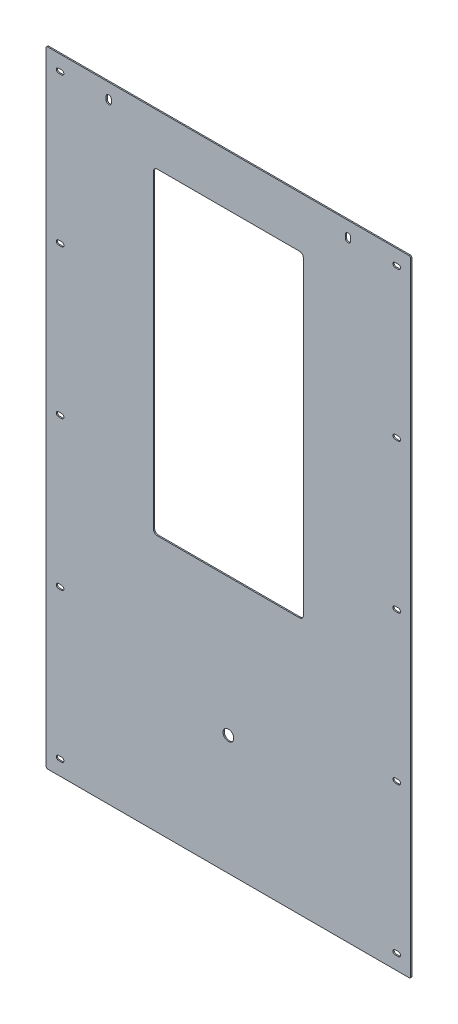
from build123d import *

# Parameters (mm, degrees)
SKIZZE1_W                       = 457
SKIZZE1_H                       = 784
AUFSATZ_LINEAR_AUSTRAGEN1_DEPTH = 1.5
SCHNITT_LINEAR_AUSTRAGEN1_DEPTH = 454.738360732
DURCHGANGSLOCH_F_R_M51_D        = 5.5
SCHNITT_LINEAR_AUSTRAGEN3_DEPTH = 454.738360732
VERRUNDUNG2_R                   = 2
DURCHGANGSLOCH_F_R_M61_D        = 6.6
SCHNITT_LINEAR_AUSTRAGEN5_DEPTH = 454.738360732
SKIZZE13_R                      = 6.7
SCHNITT_LINEAR_AUSTRAGEN6_DEPTH = 10
DURCHGANGSLOCH_F_R_M52_D        = 5.5


with BuildPart() as part:
    # Skizze1 → Aufsatz-Linear austragen1 (new body)
    with BuildSketch(Plane.XY):
        Rectangle(SKIZZE1_W, SKIZZE1_H)
    extrude(amount=AUFSATZ_LINEAR_AUSTRAGEN1_DEPTH)

    # Skizze2 → Schnitt-Linear austragen1 (cut, through all)
    with BuildSketch(Plane.XY.offset(1.5)):
        with BuildLine():
            Line((-89, -70), (89, -70))
            ThreePointArc((89, -70), (92.535533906, -68.535533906), (94, -65))
            Line((94, -65), (94, 323))
            ThreePointArc((94, 323), (92.535533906, 326.535533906), (89, 328))
            Line((89, 328), (-89, 328))
            ThreePointArc((-89, 328), (-92.535533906, 326.535533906), (-94, 323))
            Line((-94, 323), (-94, -65))
            ThreePointArc((-94, -65), (-92.535533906, -68.535533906), (-89, -70))
        make_face()
    extrude(amount=-SCHNITT_LINEAR_AUSTRAGEN1_DEPTH, mode=Mode.SUBTRACT)

    # Durchgangsloch f_r M51 (through all)
    with Locations(Plane.XY.offset(1.5)):
        with Locations((-211, 373), (-211, 0), (-211, -373), (211, -373), (211, 0), (211, 373), (211, 186.5), (211, -186.5), (-211, -186.5), (-211, 186.5)):
            Hole(DURCHGANGSLOCH_F_R_M51_D / 2)

    # Skizze6 → Schnitt-Linear austragen3 (cut, through all)
    with BuildSketch(Plane.XY.offset(1.5)):
        with BuildLine():
            Line((213, 370.25), (209, 370.25))
            ThreePointArc((209, 370.25), (206.25, 373), (209, 375.75))
            Line((209, 375.75), (213, 375.75))
            ThreePointArc((213, 375.75), (215.75, 373), (213, 370.25))
        make_face()
        with BuildLine():
            Line((213, 183.75), (209, 183.75))
            ThreePointArc((209, 183.75), (206.25, 186.5), (209, 189.25))
            Line((209, 189.25), (213, 189.25))
            ThreePointArc((213, 189.25), (215.75, 186.5), (213, 183.75))
        make_face()
        with BuildLine():
            Line((213, -2.75), (209, -2.75))
            ThreePointArc((209, -2.75), (206.25, 0), (209, 2.75))
            Line((209, 2.75), (213, 2.75))
            ThreePointArc((213, 2.75), (215.75, 0), (213, -2.75))
        make_face()
        with BuildLine():
            Line((213, -189.25), (209, -189.25))
            ThreePointArc((209, -189.25), (206.25, -186.5), (209, -183.75))
            Line((209, -183.75), (213, -183.75))
            ThreePointArc((213, -183.75), (215.75, -186.5), (213, -189.25))
        make_face()
        with BuildLine():
            Line((213, -375.75), (209, -375.75))
            ThreePointArc((209, -375.75), (206.25, -373), (209, -370.25))
            Line((209, -370.25), (213, -370.25))
            ThreePointArc((213, -370.25), (215.75, -373), (213, -375.75))
        make_face()
        with BuildLine():
            Line((-213, 370.25), (-209, 370.25))
            ThreePointArc((-209, 370.25), (-206.25, 373), (-209, 375.75))
            Line((-209, 375.75), (-213, 375.75))
            ThreePointArc((-213, 375.75), (-215.75, 373), (-213, 370.25))
        make_face()
        with BuildLine():
            Line((-213, 183.75), (-209, 183.75))
            ThreePointArc((-209, 183.75), (-206.25, 186.5), (-209, 189.25))
            Line((-209, 189.25), (-213, 189.25))
            ThreePointArc((-213, 189.25), (-215.75, 186.5), (-213, 183.75))
        make_face()
        with BuildLine():
            Line((-213, -2.75), (-209, -2.75))
            ThreePointArc((-209, -2.75), (-206.25, 0), (-209, 2.75))
            Line((-209, 2.75), (-213, 2.75))
            ThreePointArc((-213, 2.75), (-215.75, 0), (-213, -2.75))
        make_face()
        with BuildLine():
            Line((-213, -189.25), (-209, -189.25))
            ThreePointArc((-209, -189.25), (-206.25, -186.5), (-209, -183.75))
            Line((-209, -183.75), (-213, -183.75))
            ThreePointArc((-213, -183.75), (-215.75, -186.5), (-213, -189.25))
        make_face()
        with BuildLine():
            Line((-213, -375.75), (-209, -375.75))
            ThreePointArc((-209, -375.75), (-206.25, -373), (-209, -370.25))
            Line((-209, -370.25), (-213, -370.25))
            ThreePointArc((-213, -370.25), (-215.75, -373), (-213, -375.75))
        make_face()
    extrude(amount=-SCHNITT_LINEAR_AUSTRAGEN3_DEPTH, mode=Mode.SUBTRACT)

    # Verrundung2
    verrundung2_edges = [part.edges().sort_by_distance(p)[0] for p in [
        (-228.5, -392, 0.75),
        (228.5, -392, 0.75),
        (228.5, 392, 0.75),
        (-228.5, 392, 0.75),
    ]]
    fillet(verrundung2_edges, radius=VERRUNDUNG2_R)

    # Durchgangsloch f_r M61 (through all)
    with Locations(Plane.XY.offset(1.5)):
        with Locations((-150, 373), (150, 373)):
            Hole(DURCHGANGSLOCH_F_R_M61_D / 2)

    # Skizze12 → Schnitt-Linear austragen5 (cut, through all)
    with BuildSketch(Plane.XY.offset(1.5)):
        with BuildLine():
            Line((-153.3, 371), (-153.3, 375))
            ThreePointArc((-153.3, 375), (-150, 378.3), (-146.7, 375))
            Line((-146.7, 375), (-146.7, 371))
            ThreePointArc((-146.7, 371), (-150, 367.7), (-153.3, 371))
        make_face()
        with BuildLine():
            Line((146.7, 371), (146.7, 375))
            ThreePointArc((146.7, 375), (150, 378.3), (153.3, 375))
            Line((153.3, 375), (153.3, 371))
            ThreePointArc((153.3, 371), (150, 367.7), (146.7, 371))
        make_face()
    extrude(amount=-SCHNITT_LINEAR_AUSTRAGEN5_DEPTH, mode=Mode.SUBTRACT)

    # Skizze13 → Schnitt-Linear austragen6 (cut)
    with BuildSketch(Plane.XY.offset(1.5)):
        with Locations((0, -242)):
            Circle(SKIZZE13_R)
    extrude(amount=-SCHNITT_LINEAR_AUSTRAGEN6_DEPTH, mode=Mode.SUBTRACT)

    # Durchgangsloch f_r M52 (through all)
    with Locations(Plane.XY.offset(1.5)):
        with Locations((0, 40), (-44, 175), (44, 175)):
            Hole(DURCHGANGSLOCH_F_R_M52_D / 2)


solid = part.part
